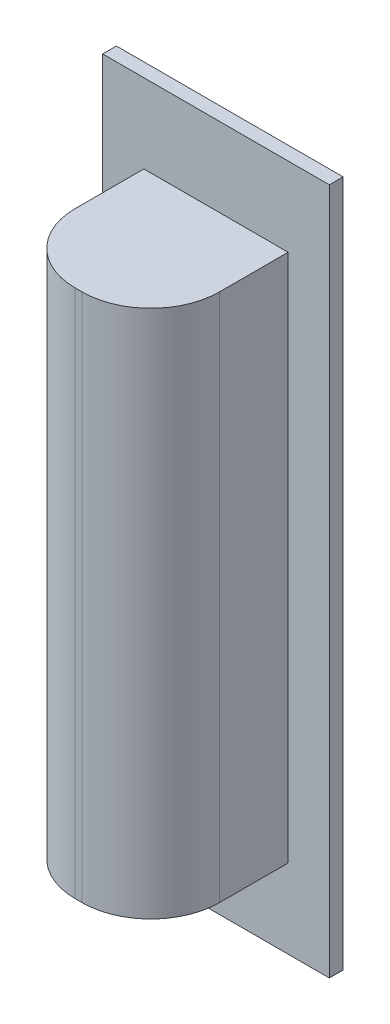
ISO-10303-21;
HEADER;
FILE_DESCRIPTION(('STEP AP214'),'2;1');
FILE_NAME('part.step','',(''),(''),'','','');
FILE_SCHEMA(('AUTOMOTIVE_DESIGN { 1 0 10303 214 1 1 1 1 }'));
ENDSEC;
DATA;
#1=APPLICATION_CONTEXT('core data for automotive mechanical design processes');
#2=APPLICATION_PROTOCOL_DEFINITION('international standard','automotive_design',2000,#1);
#3=PRODUCT_CONTEXT('',#1,'mechanical');
#4=PRODUCT('Part','Part','',(#3));
#5=PRODUCT_RELATED_PRODUCT_CATEGORY('part','',(#4));
#6=PRODUCT_DEFINITION_FORMATION('','',#4);
#7=PRODUCT_DEFINITION_CONTEXT('part definition',#1,'design');
#8=PRODUCT_DEFINITION('design','',#6,#7);
#9=PRODUCT_DEFINITION_SHAPE('','',#8);
#10=(LENGTH_UNIT() NAMED_UNIT(*) SI_UNIT(.MILLI.,.METRE.));
#11=(NAMED_UNIT(*) PLANE_ANGLE_UNIT() SI_UNIT($,.RADIAN.));
#12=(NAMED_UNIT(*) SI_UNIT($,.STERADIAN.) SOLID_ANGLE_UNIT());
#13=UNCERTAINTY_MEASURE_WITH_UNIT(LENGTH_MEASURE(1.E-05),#10,'distance_accuracy_value','');
#14=(GEOMETRIC_REPRESENTATION_CONTEXT(3) GLOBAL_UNCERTAINTY_ASSIGNED_CONTEXT((#13)) GLOBAL_UNIT_ASSIGNED_CONTEXT((#10,
#11,#12)) REPRESENTATION_CONTEXT('',''));
#15=CARTESIAN_POINT('',(0.,0.,0.));
#16=DIRECTION('',(0.,0.,1.));
#17=DIRECTION('',(1.,0.,0.));
#18=AXIS2_PLACEMENT_3D('',#15,#16,#17);
#19=CARTESIAN_POINT('',(-11.25,-4.59000000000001,-12.));
#20=DIRECTION('',(1.,0.,0.));
#21=DIRECTION('',(0.,0.,-1.));
#22=AXIS2_PLACEMENT_3D('',#19,#20,#21);
#23=PLANE('',#22);
#24=CARTESIAN_POINT('',(-11.25,-7.59000000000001,-8.72354753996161));
#25=DIRECTION('',(-1.,0.,0.));
#26=DIRECTION('',(0.,0.,1.));
#27=AXIS2_PLACEMENT_3D('',#24,#25,#26);
#28=CIRCLE('',#27,3.125);
#29=CARTESIAN_POINT('',(-11.25,-10.59,-7.84854753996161));
#30=VERTEX_POINT('',#29);
#31=CARTESIAN_POINT('',(-11.25,-4.59000000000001,-7.84854753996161));
#32=VERTEX_POINT('',#31);
#33=EDGE_CURVE('E173',#30,#32,#28,.T.);
#34=ORIENTED_EDGE('',*,*,#33,.F.);
#35=DIRECTION('',(0.,0.,1.));
#36=VECTOR('',#35,1.);
#37=CARTESIAN_POINT('',(-11.25,-10.59,-12.));
#38=LINE('',#37,#36);
#39=CARTESIAN_POINT('',(-11.25,-10.59,0.));
#40=VERTEX_POINT('',#39);
#41=EDGE_CURVE('E160',#30,#40,#38,.T.);
#42=ORIENTED_EDGE('',*,*,#41,.T.);
#43=DIRECTION('',(0.,1.,0.));
#44=VECTOR('',#43,1.);
#45=CARTESIAN_POINT('',(-11.25,-4.59000000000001,0.));
#46=LINE('',#45,#44);
#47=CARTESIAN_POINT('',(-11.25,-4.59000000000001,0.));
#48=VERTEX_POINT('',#47);
#49=EDGE_CURVE('E197',#40,#48,#46,.T.);
#50=ORIENTED_EDGE('',*,*,#49,.T.);
#51=DIRECTION('',(0.,0.,1.));
#52=VECTOR('',#51,1.);
#53=CARTESIAN_POINT('',(-11.25,-4.59000000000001,-12.));
#54=LINE('',#53,#52);
#55=EDGE_CURVE('E61',#32,#48,#54,.T.);
#56=ORIENTED_EDGE('',*,*,#55,.F.);
#57=EDGE_LOOP('',(#34,#42,#50,#56));
#58=FACE_BOUND('',#57,.T.);
#59=ADVANCED_FACE('F45',(#58),#23,.F.);
#60=CARTESIAN_POINT('',(0.,0.,0.));
#61=DIRECTION('',(0.,0.,1.));
#62=DIRECTION('',(1.,0.,0.));
#63=AXIS2_PLACEMENT_3D('',#60,#61,#62);
#64=PLANE('',#63);
#65=DIRECTION('',(0.,1.,0.));
#66=VECTOR('',#65,1.);
#67=CARTESIAN_POINT('',(16.5,50.,0.));
#68=LINE('',#67,#66);
#69=CARTESIAN_POINT('',(16.5,-50.,0.));
#70=VERTEX_POINT('',#69);
#71=CARTESIAN_POINT('',(16.5,50.,0.));
#72=VERTEX_POINT('',#71);
#73=EDGE_CURVE('E269',#70,#72,#68,.T.);
#74=ORIENTED_EDGE('',*,*,#73,.F.);
#75=DIRECTION('',(1.,0.,0.));
#76=VECTOR('',#75,1.);
#77=CARTESIAN_POINT('',(-16.5,-50.,0.));
#78=LINE('',#77,#76);
#79=CARTESIAN_POINT('',(-16.5,-50.,0.));
#80=VERTEX_POINT('',#79);
#81=EDGE_CURVE('E275',#80,#70,#78,.T.);
#82=ORIENTED_EDGE('',*,*,#81,.F.);
#83=DIRECTION('',(0.,-1.,0.));
#84=VECTOR('',#83,1.);
#85=CARTESIAN_POINT('',(-16.5,50.,0.));
#86=LINE('',#85,#84);
#87=CARTESIAN_POINT('',(-16.5,50.,0.));
#88=VERTEX_POINT('',#87);
#89=EDGE_CURVE('E291',#88,#80,#86,.T.);
#90=ORIENTED_EDGE('',*,*,#89,.F.);
#91=DIRECTION('',(-1.,0.,0.));
#92=VECTOR('',#91,1.);
#93=CARTESIAN_POINT('',(-16.5,50.,0.));
#94=LINE('',#93,#92);
#95=EDGE_CURVE('E288',#72,#88,#94,.T.);
#96=ORIENTED_EDGE('',*,*,#95,.F.);
#97=EDGE_LOOP('',(#74,#82,#90,#96));
#98=FACE_BOUND('',#97,.T.);
#99=ORIENTED_EDGE('',*,*,#49,.F.);
#100=DIRECTION('',(-1.,0.,0.));
#101=VECTOR('',#100,1.);
#102=CARTESIAN_POINT('',(-5.24999999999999,-10.59,0.));
#103=LINE('',#102,#101);
#104=CARTESIAN_POINT('',(-5.24999999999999,-10.59,0.));
#105=VERTEX_POINT('',#104);
#106=EDGE_CURVE('E166',#105,#40,#103,.T.);
#107=ORIENTED_EDGE('',*,*,#106,.F.);
#108=DIRECTION('',(0.,-1.,0.));
#109=VECTOR('',#108,1.);
#110=CARTESIAN_POINT('',(-5.24999999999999,-4.59000000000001,0.));
#111=LINE('',#110,#109);
#112=CARTESIAN_POINT('',(-5.24999999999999,-4.59000000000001,0.));
#113=VERTEX_POINT('',#112);
#114=EDGE_CURVE('E216',#113,#105,#111,.T.);
#115=ORIENTED_EDGE('',*,*,#114,.F.);
#116=DIRECTION('',(1.,0.,0.));
#117=VECTOR('',#116,1.);
#118=CARTESIAN_POINT('',(-5.24999999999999,-4.59000000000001,0.));
#119=LINE('',#118,#117);
#120=EDGE_CURVE('E212',#48,#113,#119,.T.);
#121=ORIENTED_EDGE('',*,*,#120,.F.);
#122=EDGE_LOOP('',(#99,#107,#115,#121));
#123=FACE_BOUND('',#122,.T.);
#124=ADVANCED_FACE('F373',(#98,#123),#64,.F.);
#125=CARTESIAN_POINT('',(16.5,50.,2.));
#126=DIRECTION('',(-1.,0.,0.));
#127=DIRECTION('',(0.,-1.,0.));
#128=AXIS2_PLACEMENT_3D('',#125,#126,#127);
#129=PLANE('',#128);
#130=ORIENTED_EDGE('',*,*,#73,.T.);
#131=DIRECTION('',(0.,0.,-1.));
#132=VECTOR('',#131,1.);
#133=CARTESIAN_POINT('',(16.5,50.,2.));
#134=LINE('',#133,#132);
#135=CARTESIAN_POINT('',(16.5,50.,2.));
#136=VERTEX_POINT('',#135);
#137=EDGE_CURVE('E307',#136,#72,#134,.T.);
#138=ORIENTED_EDGE('',*,*,#137,.F.);
#139=DIRECTION('',(0.,1.,0.));
#140=VECTOR('',#139,1.);
#141=CARTESIAN_POINT('',(16.5,50.,2.));
#142=LINE('',#141,#140);
#143=CARTESIAN_POINT('',(16.5,-50.,2.));
#144=VERTEX_POINT('',#143);
#145=EDGE_CURVE('E270',#144,#136,#142,.T.);
#146=ORIENTED_EDGE('',*,*,#145,.F.);
#147=DIRECTION('',(0.,0.,-1.));
#148=VECTOR('',#147,1.);
#149=CARTESIAN_POINT('',(16.5,-50.,2.));
#150=LINE('',#149,#148);
#151=EDGE_CURVE('E284',#144,#70,#150,.T.);
#152=ORIENTED_EDGE('',*,*,#151,.T.);
#153=EDGE_LOOP('',(#130,#138,#146,#152));
#154=FACE_BOUND('',#153,.T.);
#155=ADVANCED_FACE('F377',(#154),#129,.F.);
#156=CARTESIAN_POINT('',(-16.5,50.,2.));
#157=DIRECTION('',(0.,-1.,0.));
#158=DIRECTION('',(0.,0.,-1.));
#159=AXIS2_PLACEMENT_3D('',#156,#157,#158);
#160=PLANE('',#159);
#161=ORIENTED_EDGE('',*,*,#95,.T.);
#162=DIRECTION('',(0.,0.,-1.));
#163=VECTOR('',#162,1.);
#164=CARTESIAN_POINT('',(-16.5,50.,2.));
#165=LINE('',#164,#163);
#166=CARTESIAN_POINT('',(-16.5,50.,2.));
#167=VERTEX_POINT('',#166);
#168=EDGE_CURVE('E303',#167,#88,#165,.T.);
#169=ORIENTED_EDGE('',*,*,#168,.F.);
#170=DIRECTION('',(-1.,0.,0.));
#171=VECTOR('',#170,1.);
#172=CARTESIAN_POINT('',(-16.5,50.,2.));
#173=LINE('',#172,#171);
#174=EDGE_CURVE('E274',#136,#167,#173,.T.);
#175=ORIENTED_EDGE('',*,*,#174,.F.);
#176=ORIENTED_EDGE('',*,*,#137,.T.);
#177=EDGE_LOOP('',(#161,#169,#175,#176));
#178=FACE_BOUND('',#177,.T.);
#179=ADVANCED_FACE('F402',(#178),#160,.F.);
#180=CARTESIAN_POINT('',(-16.5,50.,2.));
#181=DIRECTION('',(1.,0.,0.));
#182=DIRECTION('',(0.,1.,0.));
#183=AXIS2_PLACEMENT_3D('',#180,#181,#182);
#184=PLANE('',#183);
#185=ORIENTED_EDGE('',*,*,#89,.T.);
#186=DIRECTION('',(0.,0.,-1.));
#187=VECTOR('',#186,1.);
#188=CARTESIAN_POINT('',(-16.5,-50.,2.));
#189=LINE('',#188,#187);
#190=CARTESIAN_POINT('',(-16.5,-50.,2.));
#191=VERTEX_POINT('',#190);
#192=EDGE_CURVE('E299',#191,#80,#189,.T.);
#193=ORIENTED_EDGE('',*,*,#192,.F.);
#194=DIRECTION('',(0.,-1.,0.));
#195=VECTOR('',#194,1.);
#196=CARTESIAN_POINT('',(-16.5,50.,2.));
#197=LINE('',#196,#195);
#198=EDGE_CURVE('E278',#167,#191,#197,.T.);
#199=ORIENTED_EDGE('',*,*,#198,.F.);
#200=ORIENTED_EDGE('',*,*,#168,.T.);
#201=EDGE_LOOP('',(#185,#193,#199,#200));
#202=FACE_BOUND('',#201,.T.);
#203=ADVANCED_FACE('F398',(#202),#184,.F.);
#204=CARTESIAN_POINT('',(-16.5,-50.,2.));
#205=DIRECTION('',(0.,1.,0.));
#206=DIRECTION('',(-1.,0.,0.));
#207=AXIS2_PLACEMENT_3D('',#204,#205,#206);
#208=PLANE('',#207);
#209=ORIENTED_EDGE('',*,*,#81,.T.);
#210=ORIENTED_EDGE('',*,*,#151,.F.);
#211=DIRECTION('',(1.,0.,0.));
#212=VECTOR('',#211,1.);
#213=CARTESIAN_POINT('',(-16.5,-50.,2.));
#214=LINE('',#213,#212);
#215=EDGE_CURVE('E281',#191,#144,#214,.T.);
#216=ORIENTED_EDGE('',*,*,#215,.F.);
#217=ORIENTED_EDGE('',*,*,#192,.T.);
#218=EDGE_LOOP('',(#209,#210,#216,#217));
#219=FACE_BOUND('',#218,.T.);
#220=ADVANCED_FACE('F394',(#219),#208,.F.);
#221=CARTESIAN_POINT('',(0.,0.,2.));
#222=DIRECTION('',(0.,0.,1.));
#223=DIRECTION('',(1.,0.,0.));
#224=AXIS2_PLACEMENT_3D('',#221,#222,#223);
#225=PLANE('',#224);
#226=DIRECTION('',(0.,1.,0.));
#227=VECTOR('',#226,1.);
#228=CARTESIAN_POINT('',(10.5,-38.5,2.));
#229=LINE('',#228,#227);
#230=CARTESIAN_POINT('',(10.5,-38.5,2.));
#231=VERTEX_POINT('',#230);
#232=CARTESIAN_POINT('',(10.5,38.5,2.));
#233=VERTEX_POINT('',#232);
#234=EDGE_CURVE('E233',#231,#233,#229,.T.);
#235=ORIENTED_EDGE('',*,*,#234,.F.);
#236=DIRECTION('',(1.,0.,0.));
#237=VECTOR('',#236,1.);
#238=CARTESIAN_POINT('',(-10.5,-38.5,2.));
#239=LINE('',#238,#237);
#240=CARTESIAN_POINT('',(-10.5,-38.5,2.));
#241=VERTEX_POINT('',#240);
#242=EDGE_CURVE('E239',#241,#231,#239,.T.);
#243=ORIENTED_EDGE('',*,*,#242,.F.);
#244=DIRECTION('',(0.,-1.,0.));
#245=VECTOR('',#244,1.);
#246=CARTESIAN_POINT('',(-10.5,-38.5,2.));
#247=LINE('',#246,#245);
#248=CARTESIAN_POINT('',(-10.5,38.5,2.));
#249=VERTEX_POINT('',#248);
#250=EDGE_CURVE('E251',#249,#241,#247,.T.);
#251=ORIENTED_EDGE('',*,*,#250,.F.);
#252=DIRECTION('',(-1.,0.,0.));
#253=VECTOR('',#252,1.);
#254=CARTESIAN_POINT('',(-10.5,38.5,2.));
#255=LINE('',#254,#253);
#256=EDGE_CURVE('E247',#233,#249,#255,.T.);
#257=ORIENTED_EDGE('',*,*,#256,.F.);
#258=EDGE_LOOP('',(#235,#243,#251,#257));
#259=FACE_BOUND('',#258,.T.);
#260=ORIENTED_EDGE('',*,*,#145,.T.);
#261=ORIENTED_EDGE('',*,*,#174,.T.);
#262=ORIENTED_EDGE('',*,*,#198,.T.);
#263=ORIENTED_EDGE('',*,*,#215,.T.);
#264=EDGE_LOOP('',(#260,#261,#262,#263));
#265=FACE_BOUND('',#264,.T.);
#266=ADVANCED_FACE('F354',(#259,#265),#225,.T.);
#267=CARTESIAN_POINT('',(10.5,-38.5,22.));
#268=DIRECTION('',(-1.,0.,0.));
#269=DIRECTION('',(0.,0.,1.));
#270=AXIS2_PLACEMENT_3D('',#267,#268,#269);
#271=PLANE('',#270);
#272=DIRECTION('',(0.,0.,-1.));
#273=VECTOR('',#272,1.);
#274=CARTESIAN_POINT('',(10.5,38.5,22.));
#275=LINE('',#274,#273);
#276=CARTESIAN_POINT('',(10.5,38.5,12.));
#277=VERTEX_POINT('',#276);
#278=EDGE_CURVE('E266',#277,#233,#275,.T.);
#279=ORIENTED_EDGE('',*,*,#278,.F.);
#280=DIRECTION('',(0.,1.,0.));
#281=VECTOR('',#280,1.);
#282=CARTESIAN_POINT('',(10.5,-38.5,12.));
#283=LINE('',#282,#281);
#284=CARTESIAN_POINT('',(10.5,-38.5,12.));
#285=VERTEX_POINT('',#284);
#286=EDGE_CURVE('E11',#277,#285,#283,.F.);
#287=ORIENTED_EDGE('',*,*,#286,.T.);
#288=DIRECTION('',(0.,0.,-1.));
#289=VECTOR('',#288,1.);
#290=CARTESIAN_POINT('',(10.5,-38.5,22.));
#291=LINE('',#290,#289);
#292=EDGE_CURVE('E243',#285,#231,#291,.T.);
#293=ORIENTED_EDGE('',*,*,#292,.T.);
#294=ORIENTED_EDGE('',*,*,#234,.T.);
#295=EDGE_LOOP('',(#279,#287,#293,#294));
#296=FACE_BOUND('',#295,.T.);
#297=ADVANCED_FACE('F359',(#296),#271,.F.);
#298=CARTESIAN_POINT('',(-10.5,38.5,22.));
#299=DIRECTION('',(0.,-1.,0.));
#300=DIRECTION('',(0.,0.,-1.));
#301=AXIS2_PLACEMENT_3D('',#298,#299,#300);
#302=PLANE('',#301);
#303=DIRECTION('',(0.,0.,-1.));
#304=VECTOR('',#303,1.);
#305=CARTESIAN_POINT('',(-10.5,38.5,22.));
#306=LINE('',#305,#304);
#307=CARTESIAN_POINT('',(-10.5,38.5,12.));
#308=VERTEX_POINT('',#307);
#309=EDGE_CURVE('E263',#308,#249,#306,.T.);
#310=ORIENTED_EDGE('',*,*,#309,.F.);
#311=CARTESIAN_POINT('',(-0.500000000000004,38.5,12.));
#312=DIRECTION('',(0.,-1.,0.));
#313=DIRECTION('',(0.,0.,-1.));
#314=AXIS2_PLACEMENT_3D('',#311,#312,#313);
#315=CIRCLE('',#314,10.);
#316=CARTESIAN_POINT('',(-0.500000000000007,38.5,22.));
#317=VERTEX_POINT('',#316);
#318=EDGE_CURVE('E54',#308,#317,#315,.F.);
#319=ORIENTED_EDGE('',*,*,#318,.T.);
#320=DIRECTION('',(-1.,0.,0.));
#321=VECTOR('',#320,1.);
#322=CARTESIAN_POINT('',(-10.5,38.5,22.));
#323=LINE('',#322,#321);
#324=CARTESIAN_POINT('',(0.499999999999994,38.5,22.));
#325=VERTEX_POINT('',#324);
#326=EDGE_CURVE('E234',#325,#317,#323,.T.);
#327=ORIENTED_EDGE('',*,*,#326,.F.);
#328=CARTESIAN_POINT('',(0.499999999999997,38.5,12.));
#329=DIRECTION('',(0.,-1.,0.));
#330=DIRECTION('',(0.,0.,-1.));
#331=AXIS2_PLACEMENT_3D('',#328,#329,#330);
#332=CIRCLE('',#331,10.);
#333=EDGE_CURVE('E328',#325,#277,#332,.F.);
#334=ORIENTED_EDGE('',*,*,#333,.T.);
#335=ORIENTED_EDGE('',*,*,#278,.T.);
#336=ORIENTED_EDGE('',*,*,#256,.T.);
#337=EDGE_LOOP('',(#310,#319,#327,#334,#335,#336));
#338=FACE_BOUND('',#337,.T.);
#339=ADVANCED_FACE('F335',(#338),#302,.F.);
#340=CARTESIAN_POINT('',(-10.5,-38.5,22.));
#341=DIRECTION('',(1.,0.,0.));
#342=DIRECTION('',(0.,0.,-1.));
#343=AXIS2_PLACEMENT_3D('',#340,#341,#342);
#344=PLANE('',#343);
#345=DIRECTION('',(0.,0.,-1.));
#346=VECTOR('',#345,1.);
#347=CARTESIAN_POINT('',(-10.5,-38.5,22.));
#348=LINE('',#347,#346);
#349=CARTESIAN_POINT('',(-10.5,-38.5,12.));
#350=VERTEX_POINT('',#349);
#351=EDGE_CURVE('E260',#350,#241,#348,.T.);
#352=ORIENTED_EDGE('',*,*,#351,.F.);
#353=DIRECTION('',(0.,-1.,0.));
#354=VECTOR('',#353,1.);
#355=CARTESIAN_POINT('',(-10.5,-38.5,12.));
#356=LINE('',#355,#354);
#357=EDGE_CURVE('E325',#350,#308,#356,.F.);
#358=ORIENTED_EDGE('',*,*,#357,.T.);
#359=ORIENTED_EDGE('',*,*,#309,.T.);
#360=ORIENTED_EDGE('',*,*,#250,.T.);
#361=EDGE_LOOP('',(#352,#358,#359,#360));
#362=FACE_BOUND('',#361,.T.);
#363=ADVANCED_FACE('F349',(#362),#344,.F.);
#364=CARTESIAN_POINT('',(-10.5,-38.5,22.));
#365=DIRECTION('',(0.,1.,0.));
#366=DIRECTION('',(0.,0.,1.));
#367=AXIS2_PLACEMENT_3D('',#364,#365,#366);
#368=PLANE('',#367);
#369=DIRECTION('',(1.,0.,0.));
#370=VECTOR('',#369,1.);
#371=CARTESIAN_POINT('',(-10.5,-38.5,22.));
#372=LINE('',#371,#370);
#373=CARTESIAN_POINT('',(-0.500000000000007,-38.5,22.));
#374=VERTEX_POINT('',#373);
#375=CARTESIAN_POINT('',(0.499999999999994,-38.5,22.));
#376=VERTEX_POINT('',#375);
#377=EDGE_CURVE('E238',#374,#376,#372,.T.);
#378=ORIENTED_EDGE('',*,*,#377,.F.);
#379=CARTESIAN_POINT('',(-0.500000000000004,-38.5,12.));
#380=DIRECTION('',(0.,1.,0.));
#381=DIRECTION('',(0.,0.,1.));
#382=AXIS2_PLACEMENT_3D('',#379,#380,#381);
#383=CIRCLE('',#382,10.);
#384=EDGE_CURVE('E322',#374,#350,#383,.F.);
#385=ORIENTED_EDGE('',*,*,#384,.T.);
#386=ORIENTED_EDGE('',*,*,#351,.T.);
#387=ORIENTED_EDGE('',*,*,#242,.T.);
#388=ORIENTED_EDGE('',*,*,#292,.F.);
#389=CARTESIAN_POINT('',(0.499999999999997,-38.5,12.));
#390=DIRECTION('',(0.,1.,0.));
#391=DIRECTION('',(0.,0.,1.));
#392=AXIS2_PLACEMENT_3D('',#389,#390,#391);
#393=CIRCLE('',#392,10.);
#394=EDGE_CURVE('E319',#285,#376,#393,.F.);
#395=ORIENTED_EDGE('',*,*,#394,.T.);
#396=EDGE_LOOP('',(#378,#385,#386,#387,#388,#395));
#397=FACE_BOUND('',#396,.T.);
#398=ADVANCED_FACE('F346',(#397),#368,.F.);
#399=CARTESIAN_POINT('',(0.,0.,22.));
#400=DIRECTION('',(0.,0.,-1.));
#401=DIRECTION('',(-1.,0.,0.));
#402=AXIS2_PLACEMENT_3D('',#399,#400,#401);
#403=PLANE('',#402);
#404=ORIENTED_EDGE('',*,*,#326,.T.);
#405=DIRECTION('',(0.,-1.,0.));
#406=VECTOR('',#405,1.);
#407=CARTESIAN_POINT('',(-0.500000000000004,0.,22.));
#408=LINE('',#407,#406);
#409=EDGE_CURVE('E315',#317,#374,#408,.T.);
#410=ORIENTED_EDGE('',*,*,#409,.T.);
#411=ORIENTED_EDGE('',*,*,#377,.T.);
#412=DIRECTION('',(0.,1.,0.));
#413=VECTOR('',#412,1.);
#414=CARTESIAN_POINT('',(0.499999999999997,0.,22.));
#415=LINE('',#414,#413);
#416=EDGE_CURVE('E311',#376,#325,#415,.T.);
#417=ORIENTED_EDGE('',*,*,#416,.T.);
#418=EDGE_LOOP('',(#404,#410,#411,#417));
#419=FACE_BOUND('',#418,.T.);
#420=ADVANCED_FACE('F340',(#419),#403,.F.);
#421=CARTESIAN_POINT('',(-0.500000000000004,0.,12.));
#422=DIRECTION('',(0.,-1.,0.));
#423=DIRECTION('',(0.,0.,-1.));
#424=AXIS2_PLACEMENT_3D('',#421,#422,#423);
#425=CYLINDRICAL_SURFACE('',#424,10.);
#426=ORIENTED_EDGE('',*,*,#318,.F.);
#427=ORIENTED_EDGE('',*,*,#357,.F.);
#428=ORIENTED_EDGE('',*,*,#384,.F.);
#429=ORIENTED_EDGE('',*,*,#409,.F.);
#430=EDGE_LOOP('',(#426,#427,#428,#429));
#431=FACE_BOUND('',#430,.T.);
#432=ADVANCED_FACE('F343',(#431),#425,.T.);
#433=CARTESIAN_POINT('',(0.499999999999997,0.,12.));
#434=DIRECTION('',(0.,1.,0.));
#435=DIRECTION('',(0.,0.,1.));
#436=AXIS2_PLACEMENT_3D('',#433,#434,#435);
#437=CYLINDRICAL_SURFACE('',#436,10.);
#438=ORIENTED_EDGE('',*,*,#394,.F.);
#439=ORIENTED_EDGE('',*,*,#286,.F.);
#440=ORIENTED_EDGE('',*,*,#333,.F.);
#441=ORIENTED_EDGE('',*,*,#416,.F.);
#442=EDGE_LOOP('',(#438,#439,#440,#441));
#443=FACE_BOUND('',#442,.T.);
#444=ADVANCED_FACE('F47',(#443),#437,.T.);
#445=CARTESIAN_POINT('',(-11.25,-4.59000000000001,-9.59854753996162));
#446=VERTEX_POINT('',#445);
#447=CARTESIAN_POINT('',(-11.25,-10.59,-9.59854753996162));
#448=VERTEX_POINT('',#447);
#449=EDGE_CURVE('E69',#446,#448,#28,.T.);
#450=ORIENTED_EDGE('',*,*,#449,.F.);
#451=CARTESIAN_POINT('',(-11.25,-4.59000000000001,-12.));
#452=VERTEX_POINT('',#451);
#453=EDGE_CURVE('E230',#452,#446,#54,.T.);
#454=ORIENTED_EDGE('',*,*,#453,.F.);
#455=DIRECTION('',(0.,1.,0.));
#456=VECTOR('',#455,1.);
#457=CARTESIAN_POINT('',(-11.25,-4.59000000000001,-12.));
#458=LINE('',#457,#456);
#459=CARTESIAN_POINT('',(-11.25,-10.59,-12.));
#460=VERTEX_POINT('',#459);
#461=EDGE_CURVE('E198',#460,#452,#458,.T.);
#462=ORIENTED_EDGE('',*,*,#461,.F.);
#463=EDGE_CURVE('E171',#460,#448,#38,.T.);
#464=ORIENTED_EDGE('',*,*,#463,.T.);
#465=EDGE_LOOP('',(#450,#454,#462,#464));
#466=FACE_BOUND('',#465,.T.);
#467=ADVANCED_FACE('F364',(#466),#23,.F.);
#468=CARTESIAN_POINT('',(-5.24999999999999,-4.59000000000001,-12.));
#469=DIRECTION('',(0.,-1.,0.));
#470=DIRECTION('',(0.,0.,-1.));
#471=AXIS2_PLACEMENT_3D('',#468,#469,#470);
#472=PLANE('',#471);
#473=ORIENTED_EDGE('',*,*,#120,.T.);
#474=DIRECTION('',(0.,0.,1.));
#475=VECTOR('',#474,1.);
#476=CARTESIAN_POINT('',(-5.24999999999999,-4.59000000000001,-12.));
#477=LINE('',#476,#475);
#478=CARTESIAN_POINT('',(-5.24999999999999,-4.59000000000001,-12.));
#479=VERTEX_POINT('',#478);
#480=EDGE_CURVE('E226',#479,#113,#477,.T.);
#481=ORIENTED_EDGE('',*,*,#480,.F.);
#482=DIRECTION('',(1.,0.,0.));
#483=VECTOR('',#482,1.);
#484=CARTESIAN_POINT('',(-5.24999999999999,-4.59000000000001,-12.));
#485=LINE('',#484,#483);
#486=EDGE_CURVE('E202',#452,#479,#485,.T.);
#487=ORIENTED_EDGE('',*,*,#486,.F.);
#488=ORIENTED_EDGE('',*,*,#453,.T.);
#489=DIRECTION('',(0.,0.,-1.));
#490=VECTOR('',#489,1.);
#491=CARTESIAN_POINT('',(-11.25,-4.59000000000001,-12.));
#492=LINE('',#491,#490);
#493=EDGE_CURVE('E193',#32,#446,#492,.T.);
#494=ORIENTED_EDGE('',*,*,#493,.F.);
#495=ORIENTED_EDGE('',*,*,#55,.T.);
#496=EDGE_LOOP('',(#473,#481,#487,#488,#494,#495));
#497=FACE_BOUND('',#496,.T.);
#498=ADVANCED_FACE('F370',(#497),#472,.F.);
#499=CARTESIAN_POINT('',(-5.24999999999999,-4.59000000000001,-12.));
#500=DIRECTION('',(-1.,0.,0.));
#501=DIRECTION('',(0.,-1.,0.));
#502=AXIS2_PLACEMENT_3D('',#499,#500,#501);
#503=PLANE('',#502);
#504=ORIENTED_EDGE('',*,*,#114,.T.);
#505=DIRECTION('',(0.,0.,1.));
#506=VECTOR('',#505,1.);
#507=CARTESIAN_POINT('',(-5.24999999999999,-10.59,-12.));
#508=LINE('',#507,#506);
#509=CARTESIAN_POINT('',(-5.24999999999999,-10.59,-12.));
#510=VERTEX_POINT('',#509);
#511=EDGE_CURVE('E223',#510,#105,#508,.T.);
#512=ORIENTED_EDGE('',*,*,#511,.F.);
#513=DIRECTION('',(0.,-1.,0.));
#514=VECTOR('',#513,1.);
#515=CARTESIAN_POINT('',(-5.24999999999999,-4.59000000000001,-12.));
#516=LINE('',#515,#514);
#517=EDGE_CURVE('E205',#479,#510,#516,.T.);
#518=ORIENTED_EDGE('',*,*,#517,.F.);
#519=ORIENTED_EDGE('',*,*,#480,.T.);
#520=EDGE_LOOP('',(#504,#512,#518,#519));
#521=FACE_BOUND('',#520,.T.);
#522=ADVANCED_FACE('F427',(#521),#503,.F.);
#523=CARTESIAN_POINT('',(-5.24999999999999,-10.59,-12.));
#524=DIRECTION('',(0.,1.,0.));
#525=DIRECTION('',(0.,0.,1.));
#526=AXIS2_PLACEMENT_3D('',#523,#524,#525);
#527=PLANE('',#526);
#528=ORIENTED_EDGE('',*,*,#106,.T.);
#529=ORIENTED_EDGE('',*,*,#41,.F.);
#530=EDGE_CURVE('E164',#448,#30,#38,.T.);
#531=ORIENTED_EDGE('',*,*,#530,.F.);
#532=ORIENTED_EDGE('',*,*,#463,.F.);
#533=DIRECTION('',(-1.,0.,0.));
#534=VECTOR('',#533,1.);
#535=CARTESIAN_POINT('',(-5.24999999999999,-10.59,-12.));
#536=LINE('',#535,#534);
#537=EDGE_CURVE('E169',#510,#460,#536,.T.);
#538=ORIENTED_EDGE('',*,*,#537,.F.);
#539=ORIENTED_EDGE('',*,*,#511,.T.);
#540=EDGE_LOOP('',(#528,#529,#531,#532,#538,#539));
#541=FACE_BOUND('',#540,.T.);
#542=ADVANCED_FACE('F161',(#541),#527,.F.);
#543=CARTESIAN_POINT('',(0.,0.,-12.));
#544=DIRECTION('',(0.,0.,-1.));
#545=DIRECTION('',(-1.,0.,0.));
#546=AXIS2_PLACEMENT_3D('',#543,#544,#545);
#547=PLANE('',#546);
#548=ORIENTED_EDGE('',*,*,#461,.T.);
#549=ORIENTED_EDGE('',*,*,#486,.T.);
#550=ORIENTED_EDGE('',*,*,#517,.T.);
#551=ORIENTED_EDGE('',*,*,#537,.T.);
#552=EDGE_LOOP('',(#548,#549,#550,#551));
#553=FACE_BOUND('',#552,.T.);
#554=ADVANCED_FACE('F431',(#553),#547,.T.);
#555=CARTESIAN_POINT('',(-11.25,-7.59000000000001,-8.72354753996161));
#556=DIRECTION('',(-1.,0.,0.));
#557=DIRECTION('',(0.,0.,1.));
#558=AXIS2_PLACEMENT_3D('',#555,#556,#557);
#559=PLANE('',#558);
#560=EDGE_CURVE('E181',#32,#446,#28,.T.);
#561=ORIENTED_EDGE('',*,*,#560,.F.);
#562=ORIENTED_EDGE('',*,*,#493,.T.);
#563=EDGE_LOOP('',(#561,#562));
#564=FACE_BOUND('',#563,.T.);
#565=ADVANCED_FACE('F434',(#564),#559,.F.);
#566=EDGE_CURVE('E179',#448,#30,#28,.T.);
#567=ORIENTED_EDGE('',*,*,#566,.F.);
#568=ORIENTED_EDGE('',*,*,#530,.T.);
#569=EDGE_LOOP('',(#567,#568));
#570=FACE_BOUND('',#569,.T.);
#571=ADVANCED_FACE('F184',(#570),#559,.F.);
#572=CARTESIAN_POINT('',(-19.8,-7.59000000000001,-8.72354753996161));
#573=DIRECTION('',(1.,0.,0.));
#574=DIRECTION('',(0.,0.,-1.));
#575=AXIS2_PLACEMENT_3D('',#572,#573,#574);
#576=CYLINDRICAL_SURFACE('',#575,3.125);
#577=CARTESIAN_POINT('',(-19.8,-7.59000000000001,-8.72354753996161));
#578=DIRECTION('',(-1.,0.,0.));
#579=DIRECTION('',(0.,0.,1.));
#580=AXIS2_PLACEMENT_3D('',#577,#578,#579);
#581=CIRCLE('',#580,3.125);
#582=CARTESIAN_POINT('',(-19.8,-7.59000000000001,-5.59854753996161));
#583=VERTEX_POINT('',#582);
#584=EDGE_CURVE('E192',#583,#583,#581,.T.);
#585=ORIENTED_EDGE('',*,*,#584,.F.);
#586=EDGE_LOOP('',(#585));
#587=FACE_BOUND('',#586,.T.);
#588=ORIENTED_EDGE('',*,*,#560,.T.);
#589=ORIENTED_EDGE('',*,*,#449,.T.);
#590=ORIENTED_EDGE('',*,*,#566,.T.);
#591=ORIENTED_EDGE('',*,*,#33,.T.);
#592=EDGE_LOOP('',(#588,#589,#590,#591));
#593=FACE_BOUND('',#592,.T.);
#594=ADVANCED_FACE('F186',(#587,#593),#576,.T.);
#595=CARTESIAN_POINT('',(-19.8,-7.59000000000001,-8.72354753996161));
#596=DIRECTION('',(-1.,0.,0.));
#597=DIRECTION('',(0.,0.,1.));
#598=AXIS2_PLACEMENT_3D('',#595,#596,#597);
#599=PLANE('',#598);
#600=ORIENTED_EDGE('',*,*,#584,.T.);
#601=EDGE_LOOP('',(#600));
#602=FACE_BOUND('',#601,.T.);
#603=ADVANCED_FACE('F444',(#602),#599,.T.);
#604=CLOSED_SHELL('',(#59,#124,#155,#179,#203,#220,#266,#297,#339,#363,#398,#420,#432,#444,#467,
#498,#522,#542,#554,#565,#571,#594,#603));
#605=MANIFOLD_SOLID_BREP('B2',#604);
#606=ADVANCED_BREP_SHAPE_REPRESENTATION('',(#18,#605),#14);
#607=SHAPE_DEFINITION_REPRESENTATION(#9,#606);
ENDSEC;
END-ISO-10303-21;
